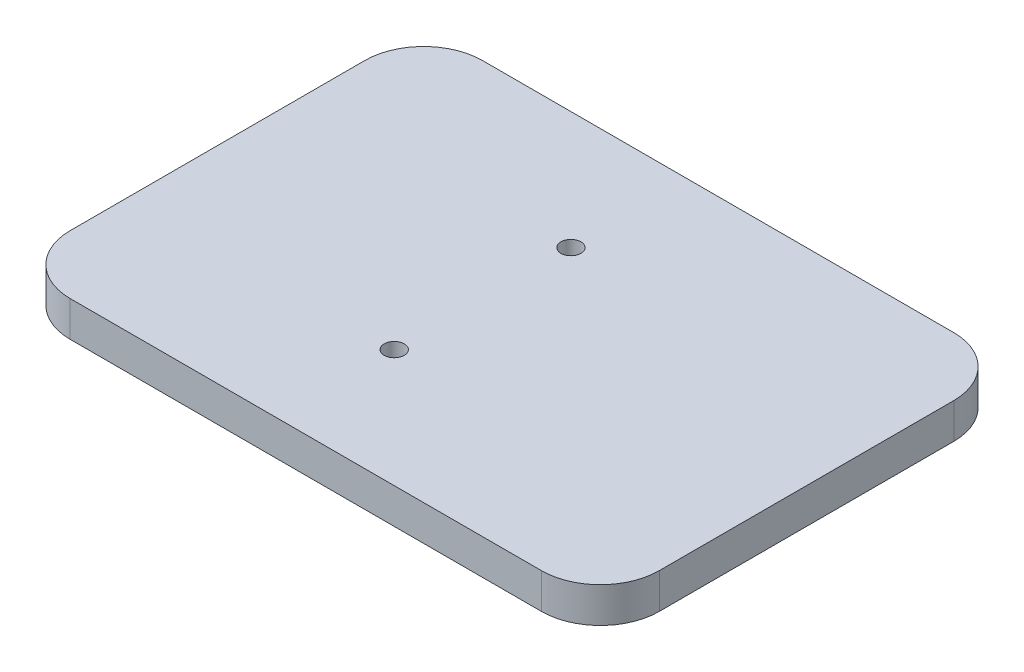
ISO-10303-21;
HEADER;
FILE_DESCRIPTION(('STEP AP214'),'2;1');
FILE_NAME('part.step','',(''),(''),'','','');
FILE_SCHEMA(('AUTOMOTIVE_DESIGN { 1 0 10303 214 1 1 1 1 }'));
ENDSEC;
DATA;
#1=APPLICATION_CONTEXT('core data for automotive mechanical design processes');
#2=APPLICATION_PROTOCOL_DEFINITION('international standard','automotive_design',2000,#1);
#3=PRODUCT_CONTEXT('',#1,'mechanical');
#4=PRODUCT('Part','Part','',(#3));
#5=PRODUCT_RELATED_PRODUCT_CATEGORY('part','',(#4));
#6=PRODUCT_DEFINITION_FORMATION('','',#4);
#7=PRODUCT_DEFINITION_CONTEXT('part definition',#1,'design');
#8=PRODUCT_DEFINITION('design','',#6,#7);
#9=PRODUCT_DEFINITION_SHAPE('','',#8);
#10=(LENGTH_UNIT() NAMED_UNIT(*) SI_UNIT(.MILLI.,.METRE.));
#11=(NAMED_UNIT(*) PLANE_ANGLE_UNIT() SI_UNIT($,.RADIAN.));
#12=(NAMED_UNIT(*) SI_UNIT($,.STERADIAN.) SOLID_ANGLE_UNIT());
#13=UNCERTAINTY_MEASURE_WITH_UNIT(LENGTH_MEASURE(1.E-05),#10,'distance_accuracy_value','');
#14=(GEOMETRIC_REPRESENTATION_CONTEXT(3) GLOBAL_UNCERTAINTY_ASSIGNED_CONTEXT((#13)) GLOBAL_UNIT_ASSIGNED_CONTEXT((#10,
#11,#12)) REPRESENTATION_CONTEXT('',''));
#15=CARTESIAN_POINT('',(0.,0.,0.));
#16=DIRECTION('',(0.,0.,1.));
#17=DIRECTION('',(1.,0.,0.));
#18=AXIS2_PLACEMENT_3D('',#15,#16,#17);
#19=CARTESIAN_POINT('',(0.,6.,0.));
#20=DIRECTION('',(1.,0.,0.));
#21=DIRECTION('',(0.,0.,-1.));
#22=AXIS2_PLACEMENT_3D('',#19,#20,#21);
#23=PLANE('',#22);
#24=DIRECTION('',(0.,0.,1.));
#25=VECTOR('',#24,1.);
#26=CARTESIAN_POINT('',(0.,0.,0.));
#27=LINE('',#26,#25);
#28=CARTESIAN_POINT('',(0.,0.,-60.));
#29=VERTEX_POINT('',#28);
#30=CARTESIAN_POINT('',(0.,0.,-10.));
#31=VERTEX_POINT('',#30);
#32=EDGE_CURVE('E124',#29,#31,#27,.T.);
#33=ORIENTED_EDGE('',*,*,#32,.T.);
#34=DIRECTION('',(0.,-1.,0.));
#35=VECTOR('',#34,1.);
#36=CARTESIAN_POINT('',(0.,6.,-10.));
#37=LINE('',#36,#35);
#38=CARTESIAN_POINT('',(0.,6.,-10.));
#39=VERTEX_POINT('',#38);
#40=EDGE_CURVE('E102',#31,#39,#37,.F.);
#41=ORIENTED_EDGE('',*,*,#40,.T.);
#42=DIRECTION('',(0.,0.,1.));
#43=VECTOR('',#42,1.);
#44=CARTESIAN_POINT('',(0.,6.,0.));
#45=LINE('',#44,#43);
#46=CARTESIAN_POINT('',(0.,6.,-60.));
#47=VERTEX_POINT('',#46);
#48=EDGE_CURVE('E134',#47,#39,#45,.T.);
#49=ORIENTED_EDGE('',*,*,#48,.F.);
#50=DIRECTION('',(0.,-1.,0.));
#51=VECTOR('',#50,1.);
#52=CARTESIAN_POINT('',(0.,6.,-60.));
#53=LINE('',#52,#51);
#54=EDGE_CURVE('E107',#47,#29,#53,.T.);
#55=ORIENTED_EDGE('',*,*,#54,.T.);
#56=EDGE_LOOP('',(#33,#41,#49,#55));
#57=FACE_BOUND('',#56,.T.);
#58=ADVANCED_FACE('F31',(#57),#23,.F.);
#59=CARTESIAN_POINT('',(0.,6.,0.));
#60=DIRECTION('',(0.,0.,-1.));
#61=DIRECTION('',(-1.,0.,0.));
#62=AXIS2_PLACEMENT_3D('',#59,#60,#61);
#63=PLANE('',#62);
#64=DIRECTION('',(1.,0.,0.));
#65=VECTOR('',#64,1.);
#66=CARTESIAN_POINT('',(0.,6.,0.));
#67=LINE('',#66,#65);
#68=CARTESIAN_POINT('',(10.,6.,0.));
#69=VERTEX_POINT('',#68);
#70=CARTESIAN_POINT('',(90.,6.,0.));
#71=VERTEX_POINT('',#70);
#72=EDGE_CURVE('E117',#69,#71,#67,.T.);
#73=ORIENTED_EDGE('',*,*,#72,.F.);
#74=DIRECTION('',(0.,-1.,0.));
#75=VECTOR('',#74,1.);
#76=CARTESIAN_POINT('',(10.,6.,0.));
#77=LINE('',#76,#75);
#78=CARTESIAN_POINT('',(10.,0.,0.));
#79=VERTEX_POINT('',#78);
#80=EDGE_CURVE('E101',#69,#79,#77,.T.);
#81=ORIENTED_EDGE('',*,*,#80,.T.);
#82=DIRECTION('',(1.,0.,0.));
#83=VECTOR('',#82,1.);
#84=CARTESIAN_POINT('',(0.,0.,0.));
#85=LINE('',#84,#83);
#86=CARTESIAN_POINT('',(90.,0.,0.));
#87=VERTEX_POINT('',#86);
#88=EDGE_CURVE('E114',#79,#87,#85,.T.);
#89=ORIENTED_EDGE('',*,*,#88,.T.);
#90=DIRECTION('',(0.,-1.,0.));
#91=VECTOR('',#90,1.);
#92=CARTESIAN_POINT('',(90.,6.,0.));
#93=LINE('',#92,#91);
#94=EDGE_CURVE('E119',#87,#71,#93,.F.);
#95=ORIENTED_EDGE('',*,*,#94,.T.);
#96=EDGE_LOOP('',(#73,#81,#89,#95));
#97=FACE_BOUND('',#96,.T.);
#98=ADVANCED_FACE('F113',(#97),#63,.F.);
#99=CARTESIAN_POINT('',(100.,6.,0.));
#100=DIRECTION('',(-1.,0.,0.));
#101=DIRECTION('',(0.,0.,1.));
#102=AXIS2_PLACEMENT_3D('',#99,#100,#101);
#103=PLANE('',#102);
#104=DIRECTION('',(0.,0.,-1.));
#105=VECTOR('',#104,1.);
#106=CARTESIAN_POINT('',(100.,0.,0.));
#107=LINE('',#106,#105);
#108=CARTESIAN_POINT('',(100.,0.,-10.));
#109=VERTEX_POINT('',#108);
#110=CARTESIAN_POINT('',(100.,0.,-60.));
#111=VERTEX_POINT('',#110);
#112=EDGE_CURVE('E123',#109,#111,#107,.T.);
#113=ORIENTED_EDGE('',*,*,#112,.T.);
#114=DIRECTION('',(0.,-1.,0.));
#115=VECTOR('',#114,1.);
#116=CARTESIAN_POINT('',(100.,6.,-60.));
#117=LINE('',#116,#115);
#118=CARTESIAN_POINT('',(100.,6.,-60.));
#119=VERTEX_POINT('',#118);
#120=EDGE_CURVE('E11',#111,#119,#117,.F.);
#121=ORIENTED_EDGE('',*,*,#120,.T.);
#122=DIRECTION('',(0.,0.,-1.));
#123=VECTOR('',#122,1.);
#124=CARTESIAN_POINT('',(100.,6.,0.));
#125=LINE('',#124,#123);
#126=CARTESIAN_POINT('',(100.,6.,-10.));
#127=VERTEX_POINT('',#126);
#128=EDGE_CURVE('E160',#127,#119,#125,.T.);
#129=ORIENTED_EDGE('',*,*,#128,.F.);
#130=DIRECTION('',(0.,-1.,0.));
#131=VECTOR('',#130,1.);
#132=CARTESIAN_POINT('',(100.,6.,-10.));
#133=LINE('',#132,#131);
#134=EDGE_CURVE('E39',#127,#109,#133,.T.);
#135=ORIENTED_EDGE('',*,*,#134,.T.);
#136=EDGE_LOOP('',(#113,#121,#129,#135));
#137=FACE_BOUND('',#136,.T.);
#138=ADVANCED_FACE('F158',(#137),#103,.F.);
#139=CARTESIAN_POINT('',(0.,6.,-70.));
#140=DIRECTION('',(0.,0.,1.));
#141=DIRECTION('',(1.,0.,0.));
#142=AXIS2_PLACEMENT_3D('',#139,#140,#141);
#143=PLANE('',#142);
#144=DIRECTION('',(-1.,0.,0.));
#145=VECTOR('',#144,1.);
#146=CARTESIAN_POINT('',(0.,0.,-70.));
#147=LINE('',#146,#145);
#148=CARTESIAN_POINT('',(90.,0.,-70.));
#149=VERTEX_POINT('',#148);
#150=CARTESIAN_POINT('',(10.,0.,-70.));
#151=VERTEX_POINT('',#150);
#152=EDGE_CURVE('E127',#149,#151,#147,.T.);
#153=ORIENTED_EDGE('',*,*,#152,.T.);
#154=DIRECTION('',(0.,-1.,0.));
#155=VECTOR('',#154,1.);
#156=CARTESIAN_POINT('',(10.,6.,-70.));
#157=LINE('',#156,#155);
#158=CARTESIAN_POINT('',(10.,6.,-70.));
#159=VERTEX_POINT('',#158);
#160=EDGE_CURVE('E46',#151,#159,#157,.F.);
#161=ORIENTED_EDGE('',*,*,#160,.T.);
#162=DIRECTION('',(-1.,0.,0.));
#163=VECTOR('',#162,1.);
#164=CARTESIAN_POINT('',(0.,6.,-70.));
#165=LINE('',#164,#163);
#166=CARTESIAN_POINT('',(90.,6.,-70.));
#167=VERTEX_POINT('',#166);
#168=EDGE_CURVE('E135',#167,#159,#165,.T.);
#169=ORIENTED_EDGE('',*,*,#168,.F.);
#170=DIRECTION('',(0.,-1.,0.));
#171=VECTOR('',#170,1.);
#172=CARTESIAN_POINT('',(90.,6.,-70.));
#173=LINE('',#172,#171);
#174=EDGE_CURVE('E151',#167,#149,#173,.T.);
#175=ORIENTED_EDGE('',*,*,#174,.T.);
#176=EDGE_LOOP('',(#153,#161,#169,#175));
#177=FACE_BOUND('',#176,.T.);
#178=ADVANCED_FACE('F167',(#177),#143,.F.);
#179=CARTESIAN_POINT('',(0.,6.,-70.));
#180=DIRECTION('',(0.,-1.,0.));
#181=DIRECTION('',(0.,0.,-1.));
#182=AXIS2_PLACEMENT_3D('',#179,#180,#181);
#183=PLANE('',#182);
#184=CARTESIAN_POINT('',(45.,6.,-20.));
#185=DIRECTION('',(0.,-1.,0.));
#186=DIRECTION('',(0.,0.,-1.));
#187=AXIS2_PLACEMENT_3D('',#184,#185,#186);
#188=CIRCLE('',#187,1.7);
#189=CARTESIAN_POINT('',(45.,6.,-21.7));
#190=VERTEX_POINT('',#189);
#191=EDGE_CURVE('E185',#190,#190,#188,.T.);
#192=ORIENTED_EDGE('',*,*,#191,.T.);
#193=EDGE_LOOP('',(#192));
#194=FACE_BOUND('',#193,.T.);
#195=CARTESIAN_POINT('',(45.,6.,-50.));
#196=DIRECTION('',(0.,-1.,0.));
#197=DIRECTION('',(0.,0.,-1.));
#198=AXIS2_PLACEMENT_3D('',#195,#196,#197);
#199=CIRCLE('',#198,1.7);
#200=CARTESIAN_POINT('',(45.,6.,-51.7));
#201=VERTEX_POINT('',#200);
#202=EDGE_CURVE('E129',#201,#201,#199,.T.);
#203=ORIENTED_EDGE('',*,*,#202,.T.);
#204=EDGE_LOOP('',(#203));
#205=FACE_BOUND('',#204,.T.);
#206=ORIENTED_EDGE('',*,*,#48,.T.);
#207=CARTESIAN_POINT('',(10.,6.,-10.));
#208=DIRECTION('',(0.,-1.,0.));
#209=DIRECTION('',(0.,0.,-1.));
#210=AXIS2_PLACEMENT_3D('',#207,#208,#209);
#211=CIRCLE('',#210,10.);
#212=EDGE_CURVE('E149',#39,#69,#211,.F.);
#213=ORIENTED_EDGE('',*,*,#212,.T.);
#214=ORIENTED_EDGE('',*,*,#72,.T.);
#215=CARTESIAN_POINT('',(90.,6.,-10.));
#216=DIRECTION('',(0.,-1.,0.));
#217=DIRECTION('',(0.,0.,-1.));
#218=AXIS2_PLACEMENT_3D('',#215,#216,#217);
#219=CIRCLE('',#218,10.);
#220=EDGE_CURVE('E144',#71,#127,#219,.F.);
#221=ORIENTED_EDGE('',*,*,#220,.T.);
#222=ORIENTED_EDGE('',*,*,#128,.T.);
#223=CARTESIAN_POINT('',(90.,6.,-60.));
#224=DIRECTION('',(0.,-1.,0.));
#225=DIRECTION('',(0.,0.,-1.));
#226=AXIS2_PLACEMENT_3D('',#223,#224,#225);
#227=CIRCLE('',#226,10.);
#228=EDGE_CURVE('E53',#119,#167,#227,.F.);
#229=ORIENTED_EDGE('',*,*,#228,.T.);
#230=ORIENTED_EDGE('',*,*,#168,.T.);
#231=CARTESIAN_POINT('',(10.,6.,-60.));
#232=DIRECTION('',(0.,-1.,0.));
#233=DIRECTION('',(0.,0.,-1.));
#234=AXIS2_PLACEMENT_3D('',#231,#232,#233);
#235=CIRCLE('',#234,10.);
#236=EDGE_CURVE('E147',#159,#47,#235,.F.);
#237=ORIENTED_EDGE('',*,*,#236,.T.);
#238=EDGE_LOOP('',(#206,#213,#214,#221,#222,#229,#230,#237));
#239=FACE_BOUND('',#238,.T.);
#240=ADVANCED_FACE('F203',(#194,#205,#239),#183,.F.);
#241=CARTESIAN_POINT('',(0.,0.,-70.));
#242=DIRECTION('',(0.,-1.,0.));
#243=DIRECTION('',(0.,0.,-1.));
#244=AXIS2_PLACEMENT_3D('',#241,#242,#243);
#245=PLANE('',#244);
#246=CARTESIAN_POINT('',(45.,0.,-20.));
#247=DIRECTION('',(0.,-1.,0.));
#248=DIRECTION('',(0.,0.,-1.));
#249=AXIS2_PLACEMENT_3D('',#246,#247,#248);
#250=CIRCLE('',#249,3.25);
#251=CARTESIAN_POINT('',(45.,0.,-23.25));
#252=VERTEX_POINT('',#251);
#253=EDGE_CURVE('E194',#252,#252,#250,.T.);
#254=ORIENTED_EDGE('',*,*,#253,.F.);
#255=EDGE_LOOP('',(#254));
#256=FACE_BOUND('',#255,.T.);
#257=CARTESIAN_POINT('',(45.,0.,-50.));
#258=DIRECTION('',(0.,-1.,0.));
#259=DIRECTION('',(0.,0.,-1.));
#260=AXIS2_PLACEMENT_3D('',#257,#258,#259);
#261=CIRCLE('',#260,3.25);
#262=CARTESIAN_POINT('',(45.,0.,-53.25));
#263=VERTEX_POINT('',#262);
#264=EDGE_CURVE('E182',#263,#263,#261,.T.);
#265=ORIENTED_EDGE('',*,*,#264,.F.);
#266=EDGE_LOOP('',(#265));
#267=FACE_BOUND('',#266,.T.);
#268=ORIENTED_EDGE('',*,*,#88,.F.);
#269=CARTESIAN_POINT('',(10.,0.,-10.));
#270=DIRECTION('',(0.,-1.,0.));
#271=DIRECTION('',(0.,0.,-1.));
#272=AXIS2_PLACEMENT_3D('',#269,#270,#271);
#273=CIRCLE('',#272,10.);
#274=EDGE_CURVE('E97',#79,#31,#273,.T.);
#275=ORIENTED_EDGE('',*,*,#274,.T.);
#276=ORIENTED_EDGE('',*,*,#32,.F.);
#277=CARTESIAN_POINT('',(10.,0.,-60.));
#278=DIRECTION('',(0.,-1.,0.));
#279=DIRECTION('',(0.,0.,-1.));
#280=AXIS2_PLACEMENT_3D('',#277,#278,#279);
#281=CIRCLE('',#280,10.);
#282=EDGE_CURVE('E108',#29,#151,#281,.T.);
#283=ORIENTED_EDGE('',*,*,#282,.T.);
#284=ORIENTED_EDGE('',*,*,#152,.F.);
#285=CARTESIAN_POINT('',(90.,0.,-60.));
#286=DIRECTION('',(0.,-1.,0.));
#287=DIRECTION('',(0.,0.,-1.));
#288=AXIS2_PLACEMENT_3D('',#285,#286,#287);
#289=CIRCLE('',#288,10.);
#290=EDGE_CURVE('E138',#149,#111,#289,.T.);
#291=ORIENTED_EDGE('',*,*,#290,.T.);
#292=ORIENTED_EDGE('',*,*,#112,.F.);
#293=CARTESIAN_POINT('',(90.,0.,-10.));
#294=DIRECTION('',(0.,-1.,0.));
#295=DIRECTION('',(0.,0.,-1.));
#296=AXIS2_PLACEMENT_3D('',#293,#294,#295);
#297=CIRCLE('',#296,10.);
#298=EDGE_CURVE('E118',#109,#87,#297,.T.);
#299=ORIENTED_EDGE('',*,*,#298,.T.);
#300=EDGE_LOOP('',(#268,#275,#276,#283,#284,#291,#292,#299));
#301=FACE_BOUND('',#300,.T.);
#302=ADVANCED_FACE('F121',(#256,#267,#301),#245,.T.);
#303=CARTESIAN_POINT('',(45.,0.,-50.));
#304=DIRECTION('',(0.,-1.,0.));
#305=DIRECTION('',(0.,0.,-1.));
#306=AXIS2_PLACEMENT_3D('',#303,#304,#305);
#307=CYLINDRICAL_SURFACE('',#306,1.7);
#308=ORIENTED_EDGE('',*,*,#202,.F.);
#309=EDGE_LOOP('',(#308));
#310=FACE_BOUND('',#309,.T.);
#311=CARTESIAN_POINT('',(45.,3.,-50.));
#312=DIRECTION('',(0.,-1.,0.));
#313=DIRECTION('',(0.,0.,-1.));
#314=AXIS2_PLACEMENT_3D('',#311,#312,#313);
#315=CIRCLE('',#314,1.7);
#316=CARTESIAN_POINT('',(45.,3.,-51.7));
#317=VERTEX_POINT('',#316);
#318=EDGE_CURVE('E176',#317,#317,#315,.T.);
#319=ORIENTED_EDGE('',*,*,#318,.T.);
#320=EDGE_LOOP('',(#319));
#321=FACE_BOUND('',#320,.T.);
#322=ADVANCED_FACE('F202',(#310,#321),#307,.F.);
#323=CARTESIAN_POINT('',(46.7,3.,-50.));
#324=DIRECTION('',(0.,1.,0.));
#325=DIRECTION('',(0.,0.,1.));
#326=AXIS2_PLACEMENT_3D('',#323,#324,#325);
#327=PLANE('',#326);
#328=ORIENTED_EDGE('',*,*,#318,.F.);
#329=EDGE_LOOP('',(#328));
#330=FACE_BOUND('',#329,.T.);
#331=CARTESIAN_POINT('',(45.,3.,-50.));
#332=DIRECTION('',(0.,-1.,0.));
#333=DIRECTION('',(0.,0.,-1.));
#334=AXIS2_PLACEMENT_3D('',#331,#332,#333);
#335=CIRCLE('',#334,3.25);
#336=CARTESIAN_POINT('',(45.,3.,-53.25));
#337=VERTEX_POINT('',#336);
#338=EDGE_CURVE('E179',#337,#337,#335,.T.);
#339=ORIENTED_EDGE('',*,*,#338,.T.);
#340=EDGE_LOOP('',(#339));
#341=FACE_BOUND('',#340,.T.);
#342=ADVANCED_FACE('F210',(#330,#341),#327,.F.);
#343=CARTESIAN_POINT('',(45.,0.,-50.));
#344=DIRECTION('',(0.,-1.,0.));
#345=DIRECTION('',(0.,0.,-1.));
#346=AXIS2_PLACEMENT_3D('',#343,#344,#345);
#347=CYLINDRICAL_SURFACE('',#346,3.25);
#348=ORIENTED_EDGE('',*,*,#338,.F.);
#349=EDGE_LOOP('',(#348));
#350=FACE_BOUND('',#349,.T.);
#351=ORIENTED_EDGE('',*,*,#264,.T.);
#352=EDGE_LOOP('',(#351));
#353=FACE_BOUND('',#352,.T.);
#354=ADVANCED_FACE('F207',(#350,#353),#347,.F.);
#355=CARTESIAN_POINT('',(45.,0.,-20.));
#356=DIRECTION('',(0.,-1.,0.));
#357=DIRECTION('',(0.,0.,-1.));
#358=AXIS2_PLACEMENT_3D('',#355,#356,#357);
#359=CYLINDRICAL_SURFACE('',#358,1.7);
#360=ORIENTED_EDGE('',*,*,#191,.F.);
#361=EDGE_LOOP('',(#360));
#362=FACE_BOUND('',#361,.T.);
#363=CARTESIAN_POINT('',(45.,3.,-20.));
#364=DIRECTION('',(0.,-1.,0.));
#365=DIRECTION('',(0.,0.,-1.));
#366=AXIS2_PLACEMENT_3D('',#363,#364,#365);
#367=CIRCLE('',#366,1.7);
#368=CARTESIAN_POINT('',(45.,3.,-21.7));
#369=VERTEX_POINT('',#368);
#370=EDGE_CURVE('E188',#369,#369,#367,.T.);
#371=ORIENTED_EDGE('',*,*,#370,.T.);
#372=EDGE_LOOP('',(#371));
#373=FACE_BOUND('',#372,.T.);
#374=ADVANCED_FACE('F209',(#362,#373),#359,.F.);
#375=CARTESIAN_POINT('',(46.7,3.,-20.));
#376=DIRECTION('',(0.,1.,0.));
#377=DIRECTION('',(0.,0.,1.));
#378=AXIS2_PLACEMENT_3D('',#375,#376,#377);
#379=PLANE('',#378);
#380=ORIENTED_EDGE('',*,*,#370,.F.);
#381=EDGE_LOOP('',(#380));
#382=FACE_BOUND('',#381,.T.);
#383=CARTESIAN_POINT('',(45.,3.,-20.));
#384=DIRECTION('',(0.,-1.,0.));
#385=DIRECTION('',(0.,0.,-1.));
#386=AXIS2_PLACEMENT_3D('',#383,#384,#385);
#387=CIRCLE('',#386,3.25);
#388=CARTESIAN_POINT('',(45.,3.,-23.25));
#389=VERTEX_POINT('',#388);
#390=EDGE_CURVE('E191',#389,#389,#387,.T.);
#391=ORIENTED_EDGE('',*,*,#390,.T.);
#392=EDGE_LOOP('',(#391));
#393=FACE_BOUND('',#392,.T.);
#394=ADVANCED_FACE('F217',(#382,#393),#379,.F.);
#395=CARTESIAN_POINT('',(45.,0.,-20.));
#396=DIRECTION('',(0.,-1.,0.));
#397=DIRECTION('',(0.,0.,-1.));
#398=AXIS2_PLACEMENT_3D('',#395,#396,#397);
#399=CYLINDRICAL_SURFACE('',#398,3.25);
#400=ORIENTED_EDGE('',*,*,#390,.F.);
#401=EDGE_LOOP('',(#400));
#402=FACE_BOUND('',#401,.T.);
#403=ORIENTED_EDGE('',*,*,#253,.T.);
#404=EDGE_LOOP('',(#403));
#405=FACE_BOUND('',#404,.T.);
#406=ADVANCED_FACE('F198',(#402,#405),#399,.F.);
#407=CARTESIAN_POINT('',(10.,6.,-10.));
#408=DIRECTION('',(0.,-1.,0.));
#409=DIRECTION('',(0.,0.,-1.));
#410=AXIS2_PLACEMENT_3D('',#407,#408,#409);
#411=CYLINDRICAL_SURFACE('',#410,10.);
#412=ORIENTED_EDGE('',*,*,#212,.F.);
#413=ORIENTED_EDGE('',*,*,#40,.F.);
#414=ORIENTED_EDGE('',*,*,#274,.F.);
#415=ORIENTED_EDGE('',*,*,#80,.F.);
#416=EDGE_LOOP('',(#412,#413,#414,#415));
#417=FACE_BOUND('',#416,.T.);
#418=ADVANCED_FACE('F100',(#417),#411,.T.);
#419=CARTESIAN_POINT('',(10.,6.,-60.));
#420=DIRECTION('',(0.,-1.,0.));
#421=DIRECTION('',(0.,0.,-1.));
#422=AXIS2_PLACEMENT_3D('',#419,#420,#421);
#423=CYLINDRICAL_SURFACE('',#422,10.);
#424=ORIENTED_EDGE('',*,*,#236,.F.);
#425=ORIENTED_EDGE('',*,*,#160,.F.);
#426=ORIENTED_EDGE('',*,*,#282,.F.);
#427=ORIENTED_EDGE('',*,*,#54,.F.);
#428=EDGE_LOOP('',(#424,#425,#426,#427));
#429=FACE_BOUND('',#428,.T.);
#430=ADVANCED_FACE('F234',(#429),#423,.T.);
#431=CARTESIAN_POINT('',(90.,6.,-60.));
#432=DIRECTION('',(0.,-1.,0.));
#433=DIRECTION('',(0.,0.,-1.));
#434=AXIS2_PLACEMENT_3D('',#431,#432,#433);
#435=CYLINDRICAL_SURFACE('',#434,10.);
#436=ORIENTED_EDGE('',*,*,#228,.F.);
#437=ORIENTED_EDGE('',*,*,#120,.F.);
#438=ORIENTED_EDGE('',*,*,#290,.F.);
#439=ORIENTED_EDGE('',*,*,#174,.F.);
#440=EDGE_LOOP('',(#436,#437,#438,#439));
#441=FACE_BOUND('',#440,.T.);
#442=ADVANCED_FACE('F166',(#441),#435,.T.);
#443=CARTESIAN_POINT('',(90.,6.,-10.));
#444=DIRECTION('',(0.,-1.,0.));
#445=DIRECTION('',(0.,0.,-1.));
#446=AXIS2_PLACEMENT_3D('',#443,#444,#445);
#447=CYLINDRICAL_SURFACE('',#446,10.);
#448=ORIENTED_EDGE('',*,*,#220,.F.);
#449=ORIENTED_EDGE('',*,*,#94,.F.);
#450=ORIENTED_EDGE('',*,*,#298,.F.);
#451=ORIENTED_EDGE('',*,*,#134,.F.);
#452=EDGE_LOOP('',(#448,#449,#450,#451));
#453=FACE_BOUND('',#452,.T.);
#454=ADVANCED_FACE('F33',(#453),#447,.T.);
#455=CLOSED_SHELL('',(#58,#98,#138,#178,#240,#302,#322,#342,#354,#374,#394,#406,#418,#430,#442,#454));
#456=MANIFOLD_SOLID_BREP('B2',#455);
#457=ADVANCED_BREP_SHAPE_REPRESENTATION('',(#18,#456),#14);
#458=SHAPE_DEFINITION_REPRESENTATION(#9,#457);
ENDSEC;
END-ISO-10303-21;
